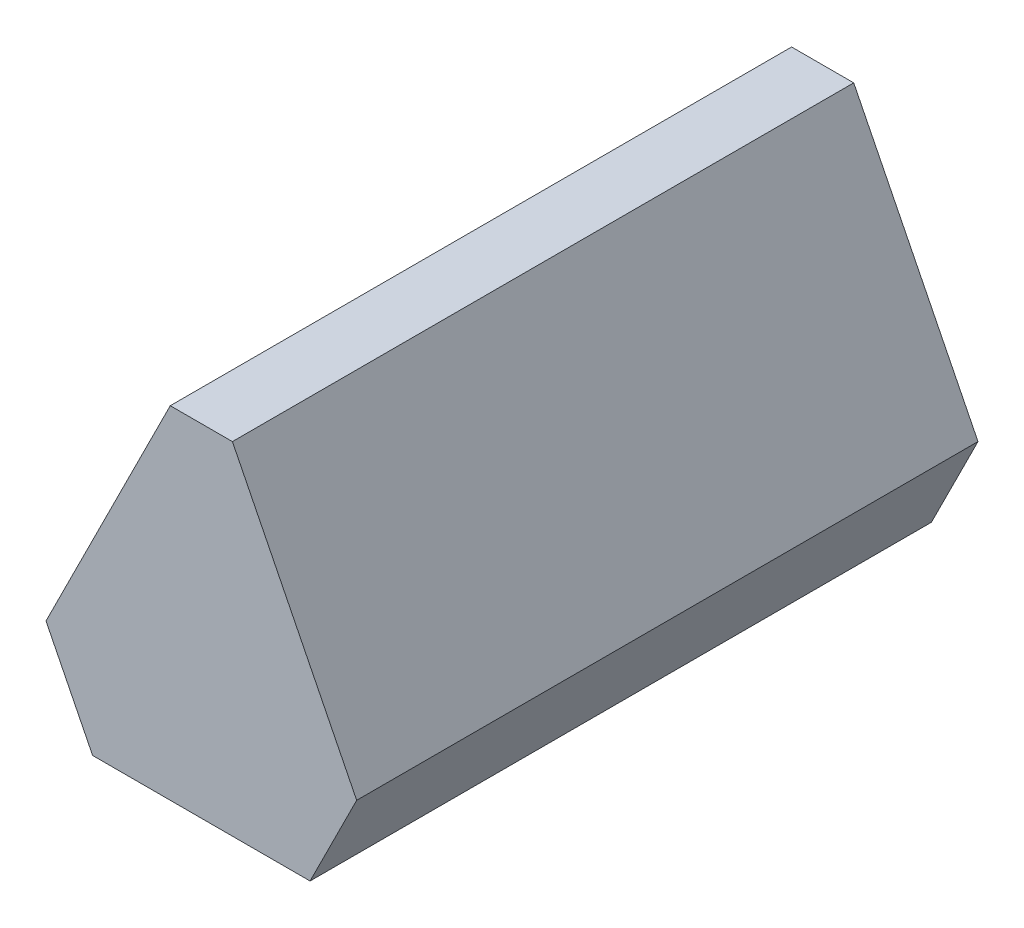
ISO-10303-21;
HEADER;
FILE_DESCRIPTION(('STEP AP214'),'2;1');
FILE_NAME('part.step','',(''),(''),'','','');
FILE_SCHEMA(('AUTOMOTIVE_DESIGN { 1 0 10303 214 1 1 1 1 }'));
ENDSEC;
DATA;
#1=APPLICATION_CONTEXT('core data for automotive mechanical design processes');
#2=APPLICATION_PROTOCOL_DEFINITION('international standard','automotive_design',2000,#1);
#3=PRODUCT_CONTEXT('',#1,'mechanical');
#4=PRODUCT('Part','Part','',(#3));
#5=PRODUCT_RELATED_PRODUCT_CATEGORY('part','',(#4));
#6=PRODUCT_DEFINITION_FORMATION('','',#4);
#7=PRODUCT_DEFINITION_CONTEXT('part definition',#1,'design');
#8=PRODUCT_DEFINITION('design','',#6,#7);
#9=PRODUCT_DEFINITION_SHAPE('','',#8);
#10=(LENGTH_UNIT() NAMED_UNIT(*) SI_UNIT(.MILLI.,.METRE.));
#11=(NAMED_UNIT(*) PLANE_ANGLE_UNIT() SI_UNIT($,.RADIAN.));
#12=(NAMED_UNIT(*) SI_UNIT($,.STERADIAN.) SOLID_ANGLE_UNIT());
#13=UNCERTAINTY_MEASURE_WITH_UNIT(LENGTH_MEASURE(1.E-05),#10,'distance_accuracy_value','');
#14=(GEOMETRIC_REPRESENTATION_CONTEXT(3) GLOBAL_UNCERTAINTY_ASSIGNED_CONTEXT((#13)) GLOBAL_UNIT_ASSIGNED_CONTEXT((#10,
#11,#12)) REPRESENTATION_CONTEXT('',''));
#15=CARTESIAN_POINT('',(0.,0.,0.));
#16=DIRECTION('',(0.,0.,1.));
#17=DIRECTION('',(1.,0.,0.));
#18=AXIS2_PLACEMENT_3D('',#15,#16,#17);
#19=CARTESIAN_POINT('',(125.,75.,250.));
#20=DIRECTION('',(-0.894427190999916,-0.447213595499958,0.));
#21=DIRECTION('',(0.447213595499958,-0.894427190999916,0.));
#22=AXIS2_PLACEMENT_3D('',#19,#20,#21);
#23=PLANE('',#22);
#24=DIRECTION('',(-0.447213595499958,0.894427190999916,0.));
#25=VECTOR('',#24,1.);
#26=CARTESIAN_POINT('',(125.,75.,-250.));
#27=LINE('',#26,#25);
#28=CARTESIAN_POINT('',(125.,75.,-250.));
#29=VERTEX_POINT('',#28);
#30=CARTESIAN_POINT('',(25.,275.,-250.));
#31=VERTEX_POINT('',#30);
#32=EDGE_CURVE('E116',#29,#31,#27,.T.);
#33=ORIENTED_EDGE('',*,*,#32,.T.);
#34=DIRECTION('',(0.,0.,-1.));
#35=VECTOR('',#34,1.);
#36=CARTESIAN_POINT('',(25.,275.,250.));
#37=LINE('',#36,#35);
#38=CARTESIAN_POINT('',(25.,275.,250.));
#39=VERTEX_POINT('',#38);
#40=EDGE_CURVE('E11',#39,#31,#37,.T.);
#41=ORIENTED_EDGE('',*,*,#40,.F.);
#42=DIRECTION('',(-0.447213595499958,0.894427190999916,0.));
#43=VECTOR('',#42,1.);
#44=CARTESIAN_POINT('',(125.,75.,250.));
#45=LINE('',#44,#43);
#46=CARTESIAN_POINT('',(125.,75.,250.));
#47=VERTEX_POINT('',#46);
#48=EDGE_CURVE('E126',#47,#39,#45,.T.);
#49=ORIENTED_EDGE('',*,*,#48,.F.);
#50=DIRECTION('',(0.,0.,-1.));
#51=VECTOR('',#50,1.);
#52=CARTESIAN_POINT('',(125.,75.,250.));
#53=LINE('',#52,#51);
#54=EDGE_CURVE('E112',#47,#29,#53,.T.);
#55=ORIENTED_EDGE('',*,*,#54,.T.);
#56=EDGE_LOOP('',(#33,#41,#49,#55));
#57=FACE_BOUND('',#56,.T.);
#58=ADVANCED_FACE('F32',(#57),#23,.F.);
#59=CARTESIAN_POINT('',(-25.,275.,250.));
#60=DIRECTION('',(0.,-1.,0.));
#61=DIRECTION('',(0.,0.,-1.));
#62=AXIS2_PLACEMENT_3D('',#59,#60,#61);
#63=PLANE('',#62);
#64=DIRECTION('',(-1.,0.,0.));
#65=VECTOR('',#64,1.);
#66=CARTESIAN_POINT('',(-25.,275.,-250.));
#67=LINE('',#66,#65);
#68=CARTESIAN_POINT('',(-25.,275.,-250.));
#69=VERTEX_POINT('',#68);
#70=EDGE_CURVE('E119',#31,#69,#67,.T.);
#71=ORIENTED_EDGE('',*,*,#70,.T.);
#72=DIRECTION('',(0.,0.,-1.));
#73=VECTOR('',#72,1.);
#74=CARTESIAN_POINT('',(-25.,275.,250.));
#75=LINE('',#74,#73);
#76=CARTESIAN_POINT('',(-25.,275.,250.));
#77=VERTEX_POINT('',#76);
#78=EDGE_CURVE('E40',#77,#69,#75,.T.);
#79=ORIENTED_EDGE('',*,*,#78,.F.);
#80=DIRECTION('',(-1.,0.,0.));
#81=VECTOR('',#80,1.);
#82=CARTESIAN_POINT('',(-25.,275.,250.));
#83=LINE('',#82,#81);
#84=EDGE_CURVE('E85',#39,#77,#83,.T.);
#85=ORIENTED_EDGE('',*,*,#84,.F.);
#86=ORIENTED_EDGE('',*,*,#40,.T.);
#87=EDGE_LOOP('',(#71,#79,#85,#86));
#88=FACE_BOUND('',#87,.T.);
#89=ADVANCED_FACE('F150',(#88),#63,.F.);
#90=CARTESIAN_POINT('',(-125.,75.,250.));
#91=DIRECTION('',(0.894427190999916,-0.447213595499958,0.));
#92=DIRECTION('',(0.447213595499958,0.894427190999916,0.));
#93=AXIS2_PLACEMENT_3D('',#90,#91,#92);
#94=PLANE('',#93);
#95=DIRECTION('',(-0.447213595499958,-0.894427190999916,0.));
#96=VECTOR('',#95,1.);
#97=CARTESIAN_POINT('',(-125.,75.,-250.));
#98=LINE('',#97,#96);
#99=CARTESIAN_POINT('',(-125.,75.,-250.));
#100=VERTEX_POINT('',#99);
#101=EDGE_CURVE('E121',#69,#100,#98,.T.);
#102=ORIENTED_EDGE('',*,*,#101,.T.);
#103=DIRECTION('',(0.,0.,-1.));
#104=VECTOR('',#103,1.);
#105=CARTESIAN_POINT('',(-125.,75.,250.));
#106=LINE('',#105,#104);
#107=CARTESIAN_POINT('',(-125.,75.,250.));
#108=VERTEX_POINT('',#107);
#109=EDGE_CURVE('E107',#108,#100,#106,.T.);
#110=ORIENTED_EDGE('',*,*,#109,.F.);
#111=DIRECTION('',(-0.447213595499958,-0.894427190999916,0.));
#112=VECTOR('',#111,1.);
#113=CARTESIAN_POINT('',(-125.,75.,250.));
#114=LINE('',#113,#112);
#115=EDGE_CURVE('E98',#77,#108,#114,.T.);
#116=ORIENTED_EDGE('',*,*,#115,.F.);
#117=ORIENTED_EDGE('',*,*,#78,.T.);
#118=EDGE_LOOP('',(#102,#110,#116,#117));
#119=FACE_BOUND('',#118,.T.);
#120=ADVANCED_FACE('F132',(#119),#94,.F.);
#121=CARTESIAN_POINT('',(-87.5,0.,250.));
#122=DIRECTION('',(0.894427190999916,0.447213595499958,0.));
#123=DIRECTION('',(-0.447213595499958,0.894427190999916,0.));
#124=AXIS2_PLACEMENT_3D('',#121,#122,#123);
#125=PLANE('',#124);
#126=DIRECTION('',(0.447213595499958,-0.894427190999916,0.));
#127=VECTOR('',#126,1.);
#128=CARTESIAN_POINT('',(-87.5,0.,-250.));
#129=LINE('',#128,#127);
#130=CARTESIAN_POINT('',(-87.5,0.,-250.));
#131=VERTEX_POINT('',#130);
#132=EDGE_CURVE('E106',#100,#131,#129,.T.);
#133=ORIENTED_EDGE('',*,*,#132,.T.);
#134=DIRECTION('',(0.,0.,-1.));
#135=VECTOR('',#134,1.);
#136=CARTESIAN_POINT('',(-87.5,0.,250.));
#137=LINE('',#136,#135);
#138=CARTESIAN_POINT('',(-87.5,0.,250.));
#139=VERTEX_POINT('',#138);
#140=EDGE_CURVE('E103',#139,#131,#137,.T.);
#141=ORIENTED_EDGE('',*,*,#140,.F.);
#142=DIRECTION('',(0.447213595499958,-0.894427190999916,0.));
#143=VECTOR('',#142,1.);
#144=CARTESIAN_POINT('',(-87.5,0.,250.));
#145=LINE('',#144,#143);
#146=EDGE_CURVE('E92',#108,#139,#145,.T.);
#147=ORIENTED_EDGE('',*,*,#146,.F.);
#148=ORIENTED_EDGE('',*,*,#109,.T.);
#149=EDGE_LOOP('',(#133,#141,#147,#148));
#150=FACE_BOUND('',#149,.T.);
#151=ADVANCED_FACE('F104',(#150),#125,.F.);
#152=CARTESIAN_POINT('',(87.5,0.,250.));
#153=DIRECTION('',(0.,1.,0.));
#154=DIRECTION('',(0.,0.,1.));
#155=AXIS2_PLACEMENT_3D('',#152,#153,#154);
#156=PLANE('',#155);
#157=DIRECTION('',(1.,0.,0.));
#158=VECTOR('',#157,1.);
#159=CARTESIAN_POINT('',(87.5,0.,-250.));
#160=LINE('',#159,#158);
#161=CARTESIAN_POINT('',(87.5,0.,-250.));
#162=VERTEX_POINT('',#161);
#163=EDGE_CURVE('E71',#131,#162,#160,.T.);
#164=ORIENTED_EDGE('',*,*,#163,.T.);
#165=DIRECTION('',(0.,0.,-1.));
#166=VECTOR('',#165,1.);
#167=CARTESIAN_POINT('',(87.5,0.,250.));
#168=LINE('',#167,#166);
#169=CARTESIAN_POINT('',(87.5,0.,250.));
#170=VERTEX_POINT('',#169);
#171=EDGE_CURVE('E108',#170,#162,#168,.T.);
#172=ORIENTED_EDGE('',*,*,#171,.F.);
#173=DIRECTION('',(1.,0.,0.));
#174=VECTOR('',#173,1.);
#175=CARTESIAN_POINT('',(87.5,0.,250.));
#176=LINE('',#175,#174);
#177=EDGE_CURVE('E96',#139,#170,#176,.T.);
#178=ORIENTED_EDGE('',*,*,#177,.F.);
#179=ORIENTED_EDGE('',*,*,#140,.T.);
#180=EDGE_LOOP('',(#164,#172,#178,#179));
#181=FACE_BOUND('',#180,.T.);
#182=ADVANCED_FACE('F110',(#181),#156,.F.);
#183=CARTESIAN_POINT('',(87.5,0.,250.));
#184=DIRECTION('',(-0.894427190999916,0.447213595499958,0.));
#185=DIRECTION('',(-0.447213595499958,-0.894427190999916,0.));
#186=AXIS2_PLACEMENT_3D('',#183,#184,#185);
#187=PLANE('',#186);
#188=DIRECTION('',(0.447213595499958,0.894427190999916,0.));
#189=VECTOR('',#188,1.);
#190=CARTESIAN_POINT('',(87.5,0.,-250.));
#191=LINE('',#190,#189);
#192=EDGE_CURVE('E77',#162,#29,#191,.T.);
#193=ORIENTED_EDGE('',*,*,#192,.T.);
#194=ORIENTED_EDGE('',*,*,#54,.F.);
#195=DIRECTION('',(0.447213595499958,0.894427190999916,0.));
#196=VECTOR('',#195,1.);
#197=CARTESIAN_POINT('',(87.5,0.,250.));
#198=LINE('',#197,#196);
#199=EDGE_CURVE('E48',#170,#47,#198,.T.);
#200=ORIENTED_EDGE('',*,*,#199,.F.);
#201=ORIENTED_EDGE('',*,*,#171,.T.);
#202=EDGE_LOOP('',(#193,#194,#200,#201));
#203=FACE_BOUND('',#202,.T.);
#204=ADVANCED_FACE('F139',(#203),#187,.F.);
#205=CARTESIAN_POINT('',(0.,0.,250.));
#206=DIRECTION('',(0.,0.,-1.));
#207=DIRECTION('',(-1.,0.,0.));
#208=AXIS2_PLACEMENT_3D('',#205,#206,#207);
#209=PLANE('',#208);
#210=ORIENTED_EDGE('',*,*,#48,.T.);
#211=ORIENTED_EDGE('',*,*,#84,.T.);
#212=ORIENTED_EDGE('',*,*,#115,.T.);
#213=ORIENTED_EDGE('',*,*,#146,.T.);
#214=ORIENTED_EDGE('',*,*,#177,.T.);
#215=ORIENTED_EDGE('',*,*,#199,.T.);
#216=EDGE_LOOP('',(#210,#211,#212,#213,#214,#215));
#217=FACE_BOUND('',#216,.T.);
#218=ADVANCED_FACE('F94',(#217),#209,.F.);
#219=CARTESIAN_POINT('',(0.,0.,-250.));
#220=DIRECTION('',(0.,0.,-1.));
#221=DIRECTION('',(-1.,0.,0.));
#222=AXIS2_PLACEMENT_3D('',#219,#220,#221);
#223=PLANE('',#222);
#224=ORIENTED_EDGE('',*,*,#32,.F.);
#225=ORIENTED_EDGE('',*,*,#192,.F.);
#226=ORIENTED_EDGE('',*,*,#163,.F.);
#227=ORIENTED_EDGE('',*,*,#132,.F.);
#228=ORIENTED_EDGE('',*,*,#101,.F.);
#229=ORIENTED_EDGE('',*,*,#70,.F.);
#230=EDGE_LOOP('',(#224,#225,#226,#227,#228,#229));
#231=FACE_BOUND('',#230,.T.);
#232=ADVANCED_FACE('F135',(#231),#223,.T.);
#233=CLOSED_SHELL('',(#58,#89,#120,#151,#182,#204,#218,#232));
#234=MANIFOLD_SOLID_BREP('B2',#233);
#235=ADVANCED_BREP_SHAPE_REPRESENTATION('',(#18,#234),#14);
#236=SHAPE_DEFINITION_REPRESENTATION(#9,#235);
ENDSEC;
END-ISO-10303-21;
